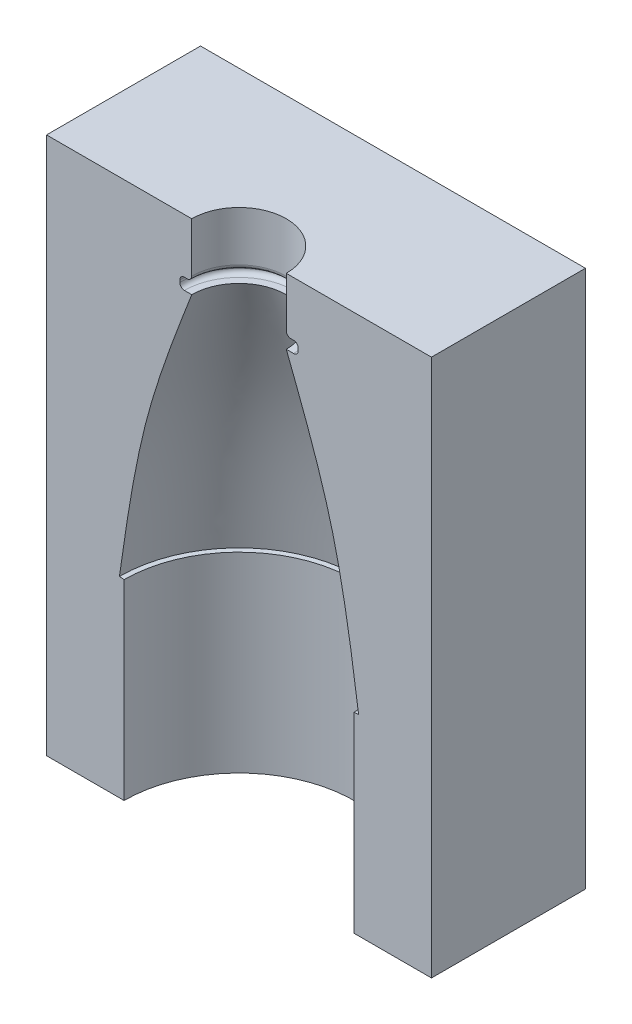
ISO-10303-21;
HEADER;
FILE_DESCRIPTION(('STEP AP214'),'2;1');
FILE_NAME('part.step','',(''),(''),'','','');
FILE_SCHEMA(('AUTOMOTIVE_DESIGN { 1 0 10303 214 1 1 1 1 }'));
ENDSEC;
DATA;
#1=APPLICATION_CONTEXT('core data for automotive mechanical design processes');
#2=APPLICATION_PROTOCOL_DEFINITION('international standard','automotive_design',2000,#1);
#3=PRODUCT_CONTEXT('',#1,'mechanical');
#4=PRODUCT('Part','Part','',(#3));
#5=PRODUCT_RELATED_PRODUCT_CATEGORY('part','',(#4));
#6=PRODUCT_DEFINITION_FORMATION('','',#4);
#7=PRODUCT_DEFINITION_CONTEXT('part definition',#1,'design');
#8=PRODUCT_DEFINITION('design','',#6,#7);
#9=PRODUCT_DEFINITION_SHAPE('','',#8);
#10=(LENGTH_UNIT() NAMED_UNIT(*) SI_UNIT(.MILLI.,.METRE.));
#11=(NAMED_UNIT(*) PLANE_ANGLE_UNIT() SI_UNIT($,.RADIAN.));
#12=(NAMED_UNIT(*) SI_UNIT($,.STERADIAN.) SOLID_ANGLE_UNIT());
#13=UNCERTAINTY_MEASURE_WITH_UNIT(LENGTH_MEASURE(1.E-05),#10,'distance_accuracy_value','');
#14=(GEOMETRIC_REPRESENTATION_CONTEXT(3) GLOBAL_UNCERTAINTY_ASSIGNED_CONTEXT((#13)) GLOBAL_UNIT_ASSIGNED_CONTEXT((#10,
#11,#12)) REPRESENTATION_CONTEXT('',''));
#15=CARTESIAN_POINT('',(0.,0.,0.));
#16=DIRECTION('',(0.,0.,1.));
#17=DIRECTION('',(1.,0.,0.));
#18=AXIS2_PLACEMENT_3D('',#15,#16,#17);
#19=CARTESIAN_POINT('',(-50.,478.395746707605,0.));
#20=DIRECTION('',(0.,0.,-1.));
#21=DIRECTION('',(-1.,0.,0.));
#22=AXIS2_PLACEMENT_3D('',#19,#20,#21);
#23=PLANE('',#22);
#24=DIRECTION('',(-1.,0.,0.));
#25=VECTOR('',#24,1.);
#26=CARTESIAN_POINT('',(321.065605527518,-72.7692633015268,0.));
#27=LINE('',#26,#25);
#28=CARTESIAN_POINT('',(-29.8600456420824,-72.7692633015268,0.));
#29=VERTEX_POINT('',#28);
#30=CARTESIAN_POINT('',(-50.,-72.7692633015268,0.));
#31=VERTEX_POINT('',#30);
#32=EDGE_CURVE('E216',#29,#31,#27,.T.);
#33=ORIENTED_EDGE('',*,*,#32,.F.);
#34=DIRECTION('',(0.,-1.,0.));
#35=VECTOR('',#34,1.);
#36=CARTESIAN_POINT('',(-29.8600456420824,-94.5670098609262,0.));
#37=LINE('',#36,#35);
#38=CARTESIAN_POINT('',(-29.8600456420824,-23.0692633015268,0.));
#39=VERTEX_POINT('',#38);
#40=EDGE_CURVE('E217',#39,#29,#37,.T.);
#41=ORIENTED_EDGE('',*,*,#40,.F.);
#42=DIRECTION('',(-0.99626171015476,0.086386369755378,0.));
#43=VECTOR('',#42,1.);
#44=CARTESIAN_POINT('',(0.,-25.6584433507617,0.));
#45=LINE('',#44,#43);
#46=CARTESIAN_POINT('',(-31.0701882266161,-22.9643312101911,0.));
#47=VERTEX_POINT('',#46);
#48=EDGE_CURVE('E219',#47,#39,#45,.F.);
#49=ORIENTED_EDGE('',*,*,#48,.F.);
#50=CARTESIAN_POINT('',(-31.0701882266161,-22.9643312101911,0.));
#51=CARTESIAN_POINT('',(-29.1413189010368,-9.4723240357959,0.));
#52=CARTESIAN_POINT('',(-25.5704753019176,15.5049239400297,0.));
#53=CARTESIAN_POINT('',(-16.4659018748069,39.0175382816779,0.));
#54=CARTESIAN_POINT('',(-12.2793630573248,49.8292993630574,0.));
#55=CARTESIAN_POINT('',(-12.1883173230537,50.0644255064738,0.));
#56=CARTESIAN_POINT('',(-12.0972715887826,50.2995516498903,0.));
#57=CARTESIAN_POINT('',(-12.0062258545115,50.5346777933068,0.));
#58=B_SPLINE_CURVE_WITH_KNOTS('',3,(#50,#51,#52,#53,#54,#55,#56,#57),.UNSPECIFIED.,.F.,.F.,(4,1,
3,4),(0.,0.540171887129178,1.,1.01),.UNSPECIFIED.);
#59=CARTESIAN_POINT('',(-12.2793630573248,49.8292993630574,0.));
#60=VERTEX_POINT('',#59);
#61=EDGE_CURVE('E221',#60,#47,#58,.F.);
#62=ORIENTED_EDGE('',*,*,#61,.F.);
#63=DIRECTION('',(1.,0.,0.));
#64=VECTOR('',#63,1.);
#65=CARTESIAN_POINT('',(15.3858253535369,49.8292993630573,0.));
#66=LINE('',#65,#64);
#67=CARTESIAN_POINT('',(-14.1858253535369,49.8292993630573,0.));
#68=VERTEX_POINT('',#67);
#69=EDGE_CURVE('E225',#68,#60,#66,.T.);
#70=ORIENTED_EDGE('',*,*,#69,.F.);
#71=CARTESIAN_POINT('',(-14.1858253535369,51.0292993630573,0.));
#72=DIRECTION('',(0.,0.,-1.));
#73=DIRECTION('',(-1.,0.,0.));
#74=AXIS2_PLACEMENT_3D('',#71,#72,#73);
#75=CIRCLE('',#74,1.2);
#76=CARTESIAN_POINT('',(-15.3858253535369,51.0292993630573,0.));
#77=VERTEX_POINT('',#76);
#78=EDGE_CURVE('E226',#77,#68,#75,.F.);
#79=ORIENTED_EDGE('',*,*,#78,.F.);
#80=DIRECTION('',(0.,-1.,0.));
#81=VECTOR('',#80,1.);
#82=CARTESIAN_POINT('',(-15.3858253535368,-94.5670098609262,0.));
#83=LINE('',#82,#81);
#84=CARTESIAN_POINT('',(-15.3858253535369,51.6014165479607,0.));
#85=VERTEX_POINT('',#84);
#86=EDGE_CURVE('E231',#85,#77,#83,.T.);
#87=ORIENTED_EDGE('',*,*,#86,.F.);
#88=CARTESIAN_POINT('',(-14.1858253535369,51.6014165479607,0.));
#89=DIRECTION('',(0.,0.,-1.));
#90=DIRECTION('',(-1.,0.,0.));
#91=AXIS2_PLACEMENT_3D('',#88,#89,#90);
#92=CIRCLE('',#91,1.2);
#93=CARTESIAN_POINT('',(-14.1858253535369,52.8014165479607,0.));
#94=VERTEX_POINT('',#93);
#95=EDGE_CURVE('E233',#94,#85,#92,.F.);
#96=ORIENTED_EDGE('',*,*,#95,.F.);
#97=DIRECTION('',(-1.,0.,0.));
#98=VECTOR('',#97,1.);
#99=CARTESIAN_POINT('',(12.2793630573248,52.8014165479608,0.));
#100=LINE('',#99,#98);
#101=CARTESIAN_POINT('',(-13.4793630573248,52.8014165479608,0.));
#102=VERTEX_POINT('',#101);
#103=EDGE_CURVE('E161',#102,#94,#100,.T.);
#104=ORIENTED_EDGE('',*,*,#103,.F.);
#105=CARTESIAN_POINT('',(-13.4793630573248,54.0014165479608,0.));
#106=DIRECTION('',(0.,0.,-1.));
#107=DIRECTION('',(-1.,0.,0.));
#108=AXIS2_PLACEMENT_3D('',#105,#106,#107);
#109=CIRCLE('',#108,1.2);
#110=CARTESIAN_POINT('',(-12.2793630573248,54.0014165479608,0.));
#111=VERTEX_POINT('',#110);
#112=EDGE_CURVE('E11',#102,#111,#109,.F.);
#113=ORIENTED_EDGE('',*,*,#112,.T.);
#114=DIRECTION('',(0.,-1.,0.));
#115=VECTOR('',#114,1.);
#116=CARTESIAN_POINT('',(-12.2793630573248,-94.5670098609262,0.));
#117=LINE('',#116,#115);
#118=CARTESIAN_POINT('',(-12.2793630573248,66.9136305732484,0.));
#119=VERTEX_POINT('',#118);
#120=EDGE_CURVE('E236',#119,#111,#117,.T.);
#121=ORIENTED_EDGE('',*,*,#120,.F.);
#122=DIRECTION('',(1.,0.,0.));
#123=VECTOR('',#122,1.);
#124=CARTESIAN_POINT('',(-50.,66.9136305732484,0.));
#125=LINE('',#124,#123);
#126=CARTESIAN_POINT('',(-50.,66.9136305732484,0.));
#127=VERTEX_POINT('',#126);
#128=EDGE_CURVE('E235',#127,#119,#125,.T.);
#129=ORIENTED_EDGE('',*,*,#128,.F.);
#130=DIRECTION('',(0.,-1.,0.));
#131=VECTOR('',#130,1.);
#132=CARTESIAN_POINT('',(-50.,478.395746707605,0.));
#133=LINE('',#132,#131);
#134=EDGE_CURVE('E262',#127,#31,#133,.T.);
#135=ORIENTED_EDGE('',*,*,#134,.T.);
#136=EDGE_LOOP('',(#33,#41,#49,#62,#70,#79,#87,#96,#104,#113,#121,#129,#135));
#137=FACE_BOUND('',#136,.T.);
#138=ADVANCED_FACE('F33',(#137),#23,.F.);
#139=CARTESIAN_POINT('',(321.065605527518,-72.7692633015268,40.));
#140=DIRECTION('',(0.,1.,0.));
#141=DIRECTION('',(0.,0.,1.));
#142=AXIS2_PLACEMENT_3D('',#139,#140,#141);
#143=PLANE('',#142);
#144=DIRECTION('',(0.,0.,-1.));
#145=VECTOR('',#144,1.);
#146=CARTESIAN_POINT('',(50.,-72.7692633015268,40.));
#147=LINE('',#146,#145);
#148=CARTESIAN_POINT('',(50.,-72.7692633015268,0.));
#149=VERTEX_POINT('',#148);
#150=CARTESIAN_POINT('',(50.,-72.7692633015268,-40.));
#151=VERTEX_POINT('',#150);
#152=EDGE_CURVE('E201',#149,#151,#147,.T.);
#153=ORIENTED_EDGE('',*,*,#152,.F.);
#154=CARTESIAN_POINT('',(29.8600456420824,-72.7692633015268,0.));
#155=VERTEX_POINT('',#154);
#156=EDGE_CURVE('E239',#149,#155,#27,.T.);
#157=ORIENTED_EDGE('',*,*,#156,.T.);
#158=CARTESIAN_POINT('',(0.,-72.7692633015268,0.));
#159=DIRECTION('',(0.,1.,0.));
#160=DIRECTION('',(0.,0.,1.));
#161=AXIS2_PLACEMENT_3D('',#158,#159,#160);
#162=CIRCLE('',#161,29.8600456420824);
#163=EDGE_CURVE('E148',#155,#29,#162,.T.);
#164=ORIENTED_EDGE('',*,*,#163,.T.);
#165=ORIENTED_EDGE('',*,*,#32,.T.);
#166=DIRECTION('',(0.,0.,1.));
#167=VECTOR('',#166,1.);
#168=CARTESIAN_POINT('',(-50.,-72.7692633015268,40.));
#169=LINE('',#168,#167);
#170=CARTESIAN_POINT('',(-50.,-72.7692633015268,-40.));
#171=VERTEX_POINT('',#170);
#172=EDGE_CURVE('E211',#171,#31,#169,.T.);
#173=ORIENTED_EDGE('',*,*,#172,.F.);
#174=DIRECTION('',(-1.,0.,0.));
#175=VECTOR('',#174,1.);
#176=CARTESIAN_POINT('',(321.065605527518,-72.7692633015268,-40.));
#177=LINE('',#176,#175);
#178=EDGE_CURVE('E214',#151,#171,#177,.T.);
#179=ORIENTED_EDGE('',*,*,#178,.F.);
#180=EDGE_LOOP('',(#153,#157,#164,#165,#173,#179));
#181=FACE_BOUND('',#180,.T.);
#182=ADVANCED_FACE('F283',(#181),#143,.F.);
#183=CARTESIAN_POINT('',(50.,-108.086369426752,40.));
#184=DIRECTION('',(-1.,0.,0.));
#185=DIRECTION('',(0.,0.,1.));
#186=AXIS2_PLACEMENT_3D('',#183,#184,#185);
#187=PLANE('',#186);
#188=DIRECTION('',(0.,0.,-1.));
#189=VECTOR('',#188,1.);
#190=CARTESIAN_POINT('',(50.,66.9136305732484,40.));
#191=LINE('',#190,#189);
#192=CARTESIAN_POINT('',(50.,66.9136305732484,0.));
#193=VERTEX_POINT('',#192);
#194=CARTESIAN_POINT('',(50.,66.9136305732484,-40.));
#195=VERTEX_POINT('',#194);
#196=EDGE_CURVE('E204',#193,#195,#191,.T.);
#197=ORIENTED_EDGE('',*,*,#196,.F.);
#198=DIRECTION('',(0.,-1.,0.));
#199=VECTOR('',#198,1.);
#200=CARTESIAN_POINT('',(50.,478.395746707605,0.));
#201=LINE('',#200,#199);
#202=EDGE_CURVE('E49',#193,#149,#201,.T.);
#203=ORIENTED_EDGE('',*,*,#202,.T.);
#204=ORIENTED_EDGE('',*,*,#152,.T.);
#205=DIRECTION('',(0.,1.,0.));
#206=VECTOR('',#205,1.);
#207=CARTESIAN_POINT('',(50.,-108.086369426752,-40.));
#208=LINE('',#207,#206);
#209=EDGE_CURVE('E177',#151,#195,#208,.T.);
#210=ORIENTED_EDGE('',*,*,#209,.T.);
#211=EDGE_LOOP('',(#197,#203,#204,#210));
#212=FACE_BOUND('',#211,.T.);
#213=ADVANCED_FACE('F332',(#212),#187,.F.);
#214=CARTESIAN_POINT('',(-50.,66.9136305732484,40.));
#215=DIRECTION('',(0.,-1.,0.));
#216=DIRECTION('',(0.,0.,-1.));
#217=AXIS2_PLACEMENT_3D('',#214,#215,#216);
#218=PLANE('',#217);
#219=DIRECTION('',(0.,0.,-1.));
#220=VECTOR('',#219,1.);
#221=CARTESIAN_POINT('',(-50.,66.9136305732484,40.));
#222=LINE('',#221,#220);
#223=CARTESIAN_POINT('',(-50.,66.9136305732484,-40.));
#224=VERTEX_POINT('',#223);
#225=EDGE_CURVE('E188',#127,#224,#222,.T.);
#226=ORIENTED_EDGE('',*,*,#225,.F.);
#227=ORIENTED_EDGE('',*,*,#128,.T.);
#228=CARTESIAN_POINT('',(0.,66.9136305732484,0.));
#229=DIRECTION('',(0.,-1.,0.));
#230=DIRECTION('',(0.,0.,-1.));
#231=AXIS2_PLACEMENT_3D('',#228,#229,#230);
#232=CIRCLE('',#231,12.2793630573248);
#233=CARTESIAN_POINT('',(12.2793630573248,66.9136305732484,0.));
#234=VERTEX_POINT('',#233);
#235=EDGE_CURVE('E171',#119,#234,#232,.T.);
#236=ORIENTED_EDGE('',*,*,#235,.T.);
#237=EDGE_CURVE('E57',#234,#193,#125,.T.);
#238=ORIENTED_EDGE('',*,*,#237,.T.);
#239=ORIENTED_EDGE('',*,*,#196,.T.);
#240=DIRECTION('',(-1.,0.,0.));
#241=VECTOR('',#240,1.);
#242=CARTESIAN_POINT('',(-50.,66.9136305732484,-40.));
#243=LINE('',#242,#241);
#244=EDGE_CURVE('E176',#195,#224,#243,.T.);
#245=ORIENTED_EDGE('',*,*,#244,.T.);
#246=EDGE_LOOP('',(#226,#227,#236,#238,#239,#245));
#247=FACE_BOUND('',#246,.T.);
#248=ADVANCED_FACE('F274',(#247),#218,.F.);
#249=CARTESIAN_POINT('',(-50.,-108.086369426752,40.));
#250=DIRECTION('',(1.,0.,0.));
#251=DIRECTION('',(0.,0.,-1.));
#252=AXIS2_PLACEMENT_3D('',#249,#250,#251);
#253=PLANE('',#252);
#254=ORIENTED_EDGE('',*,*,#172,.T.);
#255=ORIENTED_EDGE('',*,*,#134,.F.);
#256=ORIENTED_EDGE('',*,*,#225,.T.);
#257=DIRECTION('',(0.,-1.,0.));
#258=VECTOR('',#257,1.);
#259=CARTESIAN_POINT('',(-50.,-108.086369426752,-40.));
#260=LINE('',#259,#258);
#261=EDGE_CURVE('E205',#224,#171,#260,.T.);
#262=ORIENTED_EDGE('',*,*,#261,.T.);
#263=EDGE_LOOP('',(#254,#255,#256,#262));
#264=FACE_BOUND('',#263,.T.);
#265=ADVANCED_FACE('F272',(#264),#253,.F.);
#266=CARTESIAN_POINT('',(50.,66.9136305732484,-40.));
#267=DIRECTION('',(0.,0.,-1.));
#268=DIRECTION('',(-1.,0.,0.));
#269=AXIS2_PLACEMENT_3D('',#266,#267,#268);
#270=PLANE('',#269);
#271=ORIENTED_EDGE('',*,*,#178,.T.);
#272=ORIENTED_EDGE('',*,*,#261,.F.);
#273=ORIENTED_EDGE('',*,*,#244,.F.);
#274=ORIENTED_EDGE('',*,*,#209,.F.);
#275=EDGE_LOOP('',(#271,#272,#273,#274));
#276=FACE_BOUND('',#275,.T.);
#277=ADVANCED_FACE('F280',(#276),#270,.T.);
#278=CARTESIAN_POINT('',(0.,-94.5670098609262,0.));
#279=DIRECTION('',(0.,-1.,0.));
#280=DIRECTION('',(0.,0.,-1.));
#281=AXIS2_PLACEMENT_3D('',#278,#279,#280);
#282=CYLINDRICAL_SURFACE('',#281,29.8600456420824);
#283=ORIENTED_EDGE('',*,*,#163,.F.);
#284=DIRECTION('',(0.,-1.,0.));
#285=VECTOR('',#284,1.);
#286=CARTESIAN_POINT('',(29.8600456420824,-94.5670098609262,0.));
#287=LINE('',#286,#285);
#288=CARTESIAN_POINT('',(29.8600456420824,-23.0692633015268,0.));
#289=VERTEX_POINT('',#288);
#290=EDGE_CURVE('E241',#155,#289,#287,.F.);
#291=ORIENTED_EDGE('',*,*,#290,.T.);
#292=CARTESIAN_POINT('',(0.,-23.0692633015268,0.));
#293=DIRECTION('',(0.,-1.,0.));
#294=DIRECTION('',(0.,0.,-1.));
#295=AXIS2_PLACEMENT_3D('',#292,#293,#294);
#296=CIRCLE('',#295,29.8600456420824);
#297=EDGE_CURVE('E185',#39,#289,#296,.T.);
#298=ORIENTED_EDGE('',*,*,#297,.F.);
#299=ORIENTED_EDGE('',*,*,#40,.T.);
#300=EDGE_LOOP('',(#283,#291,#298,#299));
#301=FACE_BOUND('',#300,.T.);
#302=ADVANCED_FACE('F287',(#301),#282,.F.);
#303=CARTESIAN_POINT('',(0.,-23.0692633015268,0.));
#304=DIRECTION('',(0.,1.,0.));
#305=DIRECTION('',(0.,0.,1.));
#306=AXIS2_PLACEMENT_3D('',#303,#304,#305);
#307=CONICAL_SURFACE('',#306,29.8600456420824,1.48430215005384);
#308=CARTESIAN_POINT('',(0.,-22.9643312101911,0.));
#309=DIRECTION('',(0.,-1.,0.));
#310=DIRECTION('',(0.,0.,-1.));
#311=AXIS2_PLACEMENT_3D('',#308,#309,#310);
#312=CIRCLE('',#311,31.0701882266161);
#313=CARTESIAN_POINT('',(31.0701882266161,-22.9643312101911,0.));
#314=VERTEX_POINT('',#313);
#315=EDGE_CURVE('E182',#47,#314,#312,.T.);
#316=ORIENTED_EDGE('',*,*,#315,.F.);
#317=ORIENTED_EDGE('',*,*,#48,.T.);
#318=ORIENTED_EDGE('',*,*,#297,.T.);
#319=DIRECTION('',(-0.99626171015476,-0.086386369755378,0.));
#320=VECTOR('',#319,1.);
#321=CARTESIAN_POINT('',(0.,-25.6584433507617,0.));
#322=LINE('',#321,#320);
#323=EDGE_CURVE('E243',#289,#314,#322,.F.);
#324=ORIENTED_EDGE('',*,*,#323,.T.);
#325=EDGE_LOOP('',(#316,#317,#318,#324));
#326=FACE_BOUND('',#325,.T.);
#327=ADVANCED_FACE('F294',(#326),#307,.F.);
#328=CARTESIAN_POINT('',(31.0701882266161,-22.9643312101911,0.));
#329=CARTESIAN_POINT('',(29.1413189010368,-9.4723240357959,0.));
#330=CARTESIAN_POINT('',(25.5704753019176,15.5049239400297,0.));
#331=CARTESIAN_POINT('',(16.4659018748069,39.0175382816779,0.));
#332=CARTESIAN_POINT('',(12.2793630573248,49.8292993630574,0.));
#333=CARTESIAN_POINT('',(12.1883173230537,50.0644255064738,0.));
#334=CARTESIAN_POINT('',(12.0972715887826,50.2995516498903,0.));
#335=CARTESIAN_POINT('',(12.0062258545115,50.5346777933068,0.));
#336=B_SPLINE_CURVE_WITH_KNOTS('',3,(#328,#329,#330,#331,#332,#333,#334,#335),.UNSPECIFIED.,.F.,
.F.,(4,1,3,4),(0.,0.540171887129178,1.,1.01),.UNSPECIFIED.);
#337=CARTESIAN_POINT('',(0.,-94.5670098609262,0.));
#338=DIRECTION('',(0.,-1.,0.));
#339=AXIS1_PLACEMENT('',#337,#338);
#340=SURFACE_OF_REVOLUTION('',#336,#339);
#341=ORIENTED_EDGE('',*,*,#315,.T.);
#342=CARTESIAN_POINT('',(31.0701882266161,-22.9643312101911,0.));
#343=CARTESIAN_POINT('',(29.1413189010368,-9.4723240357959,0.));
#344=CARTESIAN_POINT('',(25.5704753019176,15.5049239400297,0.));
#345=CARTESIAN_POINT('',(16.4659018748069,39.0175382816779,0.));
#346=CARTESIAN_POINT('',(12.2793630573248,49.8292993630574,0.));
#347=CARTESIAN_POINT('',(12.1883173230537,50.0644255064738,0.));
#348=CARTESIAN_POINT('',(12.0972715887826,50.2995516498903,0.));
#349=CARTESIAN_POINT('',(12.0062258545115,50.5346777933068,0.));
#350=B_SPLINE_CURVE_WITH_KNOTS('',3,(#342,#343,#344,#345,#346,#347,#348,#349),.UNSPECIFIED.,.F.,
.F.,(4,1,3,4),(0.,0.540171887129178,1.,1.01),.UNSPECIFIED.);
#351=CARTESIAN_POINT('',(12.2793630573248,49.8292993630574,0.));
#352=VERTEX_POINT('',#351);
#353=EDGE_CURVE('E245',#314,#352,#350,.T.);
#354=ORIENTED_EDGE('',*,*,#353,.T.);
#355=CARTESIAN_POINT('',(0.,49.8292993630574,0.));
#356=DIRECTION('',(0.,-1.,0.));
#357=DIRECTION('',(0.,0.,-1.));
#358=AXIS2_PLACEMENT_3D('',#355,#356,#357);
#359=CIRCLE('',#358,12.2793630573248);
#360=EDGE_CURVE('E178',#60,#352,#359,.T.);
#361=ORIENTED_EDGE('',*,*,#360,.F.);
#362=ORIENTED_EDGE('',*,*,#61,.T.);
#363=EDGE_LOOP('',(#341,#354,#361,#362));
#364=FACE_BOUND('',#363,.T.);
#365=ADVANCED_FACE('F35',(#364),#340,.T.);
#366=CARTESIAN_POINT('',(15.3858253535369,49.8292993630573,0.));
#367=DIRECTION('',(0.,-1.,0.));
#368=DIRECTION('',(0.,0.,-1.));
#369=AXIS2_PLACEMENT_3D('',#366,#367,#368);
#370=PLANE('',#369);
#371=CARTESIAN_POINT('',(0.,49.8292993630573,0.));
#372=DIRECTION('',(0.,-1.,0.));
#373=DIRECTION('',(0.,0.,-1.));
#374=AXIS2_PLACEMENT_3D('',#371,#372,#373);
#375=CIRCLE('',#374,14.1858253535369);
#376=CARTESIAN_POINT('',(14.1858253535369,49.8292993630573,0.));
#377=VERTEX_POINT('',#376);
#378=EDGE_CURVE('E189',#68,#377,#375,.T.);
#379=ORIENTED_EDGE('',*,*,#378,.F.);
#380=ORIENTED_EDGE('',*,*,#69,.T.);
#381=ORIENTED_EDGE('',*,*,#360,.T.);
#382=EDGE_CURVE('E249',#352,#377,#66,.T.);
#383=ORIENTED_EDGE('',*,*,#382,.T.);
#384=EDGE_LOOP('',(#379,#380,#381,#383));
#385=FACE_BOUND('',#384,.T.);
#386=ADVANCED_FACE('F304',(#385),#370,.F.);
#387=CARTESIAN_POINT('',(0.,-94.5670098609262,0.));
#388=DIRECTION('',(0.,-1.,0.));
#389=DIRECTION('',(0.,0.,-1.));
#390=AXIS2_PLACEMENT_3D('',#387,#388,#389);
#391=CYLINDRICAL_SURFACE('',#390,15.3858253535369);
#392=CARTESIAN_POINT('',(0.,51.0292993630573,0.));
#393=DIRECTION('',(0.,-1.,0.));
#394=DIRECTION('',(0.,0.,-1.));
#395=AXIS2_PLACEMENT_3D('',#392,#393,#394);
#396=CIRCLE('',#395,15.3858253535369);
#397=CARTESIAN_POINT('',(15.3858253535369,51.0292993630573,0.));
#398=VERTEX_POINT('',#397);
#399=EDGE_CURVE('E181',#398,#77,#396,.F.);
#400=ORIENTED_EDGE('',*,*,#399,.F.);
#401=DIRECTION('',(0.,-1.,0.));
#402=VECTOR('',#401,1.);
#403=CARTESIAN_POINT('',(15.3858253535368,-94.5670098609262,0.));
#404=LINE('',#403,#402);
#405=CARTESIAN_POINT('',(15.3858253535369,51.6014165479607,0.));
#406=VERTEX_POINT('',#405);
#407=EDGE_CURVE('E256',#398,#406,#404,.F.);
#408=ORIENTED_EDGE('',*,*,#407,.T.);
#409=CARTESIAN_POINT('',(0.,51.6014165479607,0.));
#410=DIRECTION('',(0.,1.,0.));
#411=DIRECTION('',(0.,0.,1.));
#412=AXIS2_PLACEMENT_3D('',#409,#410,#411);
#413=CIRCLE('',#412,15.3858253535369);
#414=EDGE_CURVE('E192',#85,#406,#413,.F.);
#415=ORIENTED_EDGE('',*,*,#414,.F.);
#416=ORIENTED_EDGE('',*,*,#86,.T.);
#417=EDGE_LOOP('',(#400,#408,#415,#416));
#418=FACE_BOUND('',#417,.T.);
#419=ADVANCED_FACE('F312',(#418),#391,.F.);
#420=CARTESIAN_POINT('',(12.2793630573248,52.8014165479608,0.));
#421=DIRECTION('',(0.,1.,0.));
#422=DIRECTION('',(0.,0.,1.));
#423=AXIS2_PLACEMENT_3D('',#420,#421,#422);
#424=PLANE('',#423);
#425=CARTESIAN_POINT('',(0.,52.8014165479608,0.));
#426=DIRECTION('',(0.,1.,0.));
#427=DIRECTION('',(0.,0.,1.));
#428=AXIS2_PLACEMENT_3D('',#425,#426,#427);
#429=CIRCLE('',#428,14.1858253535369);
#430=CARTESIAN_POINT('',(14.1858253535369,52.8014165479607,0.));
#431=VERTEX_POINT('',#430);
#432=EDGE_CURVE('E156',#431,#94,#429,.T.);
#433=ORIENTED_EDGE('',*,*,#432,.F.);
#434=CARTESIAN_POINT('',(13.4793630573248,52.8014165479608,0.));
#435=VERTEX_POINT('',#434);
#436=EDGE_CURVE('E153',#431,#435,#100,.T.);
#437=ORIENTED_EDGE('',*,*,#436,.T.);
#438=CARTESIAN_POINT('',(0.,52.8014165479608,0.));
#439=DIRECTION('',(0.,1.,0.));
#440=DIRECTION('',(0.,0.,1.));
#441=AXIS2_PLACEMENT_3D('',#438,#439,#440);
#442=CIRCLE('',#441,13.4793630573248);
#443=EDGE_CURVE('E141',#102,#435,#442,.F.);
#444=ORIENTED_EDGE('',*,*,#443,.F.);
#445=ORIENTED_EDGE('',*,*,#103,.T.);
#446=EDGE_LOOP('',(#433,#437,#444,#445));
#447=FACE_BOUND('',#446,.T.);
#448=ADVANCED_FACE('F154',(#447),#424,.F.);
#449=CARTESIAN_POINT('',(0.,-94.5670098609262,0.));
#450=DIRECTION('',(0.,-1.,0.));
#451=DIRECTION('',(0.,0.,-1.));
#452=AXIS2_PLACEMENT_3D('',#449,#450,#451);
#453=CYLINDRICAL_SURFACE('',#452,12.2793630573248);
#454=CARTESIAN_POINT('',(0.,54.0014165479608,0.));
#455=DIRECTION('',(0.,1.,0.));
#456=DIRECTION('',(0.,0.,1.));
#457=AXIS2_PLACEMENT_3D('',#454,#455,#456);
#458=CIRCLE('',#457,12.2793630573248);
#459=CARTESIAN_POINT('',(12.2793630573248,54.0014165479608,0.));
#460=VERTEX_POINT('',#459);
#461=EDGE_CURVE('E149',#460,#111,#458,.T.);
#462=ORIENTED_EDGE('',*,*,#461,.F.);
#463=DIRECTION('',(0.,-1.,0.));
#464=VECTOR('',#463,1.);
#465=CARTESIAN_POINT('',(12.2793630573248,-94.5670098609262,0.));
#466=LINE('',#465,#464);
#467=EDGE_CURVE('E159',#460,#234,#466,.F.);
#468=ORIENTED_EDGE('',*,*,#467,.T.);
#469=ORIENTED_EDGE('',*,*,#235,.F.);
#470=ORIENTED_EDGE('',*,*,#120,.T.);
#471=EDGE_LOOP('',(#462,#468,#469,#470));
#472=FACE_BOUND('',#471,.T.);
#473=ADVANCED_FACE('F317',(#472),#453,.F.);
#474=CARTESIAN_POINT('',(0.,51.0292993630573,0.));
#475=DIRECTION('',(0.,-1.,0.));
#476=DIRECTION('',(0.,0.,-1.));
#477=AXIS2_PLACEMENT_3D('',#474,#475,#476);
#478=TOROIDAL_SURFACE('',#477,14.1858253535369,1.2);
#479=ORIENTED_EDGE('',*,*,#378,.T.);
#480=CARTESIAN_POINT('',(14.1858253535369,51.0292993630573,0.));
#481=DIRECTION('',(0.,0.,-1.));
#482=DIRECTION('',(-1.,0.,0.));
#483=AXIS2_PLACEMENT_3D('',#480,#481,#482);
#484=CIRCLE('',#483,1.2);
#485=EDGE_CURVE('E254',#377,#398,#484,.F.);
#486=ORIENTED_EDGE('',*,*,#485,.T.);
#487=ORIENTED_EDGE('',*,*,#399,.T.);
#488=ORIENTED_EDGE('',*,*,#78,.T.);
#489=EDGE_LOOP('',(#479,#486,#487,#488));
#490=FACE_BOUND('',#489,.T.);
#491=ADVANCED_FACE('F307',(#490),#478,.F.);
#492=CARTESIAN_POINT('',(0.,51.6014165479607,0.));
#493=DIRECTION('',(0.,1.,0.));
#494=DIRECTION('',(0.,0.,1.));
#495=AXIS2_PLACEMENT_3D('',#492,#493,#494);
#496=TOROIDAL_SURFACE('',#495,14.1858253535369,1.2);
#497=ORIENTED_EDGE('',*,*,#432,.T.);
#498=ORIENTED_EDGE('',*,*,#95,.T.);
#499=ORIENTED_EDGE('',*,*,#414,.T.);
#500=CARTESIAN_POINT('',(14.1858253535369,51.6014165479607,0.));
#501=DIRECTION('',(0.,0.,-1.));
#502=DIRECTION('',(-1.,0.,0.));
#503=AXIS2_PLACEMENT_3D('',#500,#501,#502);
#504=CIRCLE('',#503,1.2);
#505=EDGE_CURVE('E258',#406,#431,#504,.F.);
#506=ORIENTED_EDGE('',*,*,#505,.T.);
#507=EDGE_LOOP('',(#497,#498,#499,#506));
#508=FACE_BOUND('',#507,.T.);
#509=ADVANCED_FACE('F314',(#508),#496,.F.);
#510=CARTESIAN_POINT('',(0.,54.0014165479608,0.));
#511=DIRECTION('',(0.,1.,0.));
#512=DIRECTION('',(0.,0.,1.));
#513=AXIS2_PLACEMENT_3D('',#510,#511,#512);
#514=TOROIDAL_SURFACE('',#513,13.4793630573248,1.2);
#515=ORIENTED_EDGE('',*,*,#112,.F.);
#516=ORIENTED_EDGE('',*,*,#443,.T.);
#517=CARTESIAN_POINT('',(13.4793630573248,54.0014165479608,0.));
#518=DIRECTION('',(0.,0.,-1.));
#519=DIRECTION('',(-1.,0.,0.));
#520=AXIS2_PLACEMENT_3D('',#517,#518,#519);
#521=CIRCLE('',#520,1.2);
#522=EDGE_CURVE('E42',#460,#435,#521,.F.);
#523=ORIENTED_EDGE('',*,*,#522,.F.);
#524=ORIENTED_EDGE('',*,*,#461,.T.);
#525=EDGE_LOOP('',(#515,#516,#523,#524));
#526=FACE_BOUND('',#525,.T.);
#527=ADVANCED_FACE('F143',(#526),#514,.T.);
#528=ORIENTED_EDGE('',*,*,#156,.F.);
#529=ORIENTED_EDGE('',*,*,#202,.F.);
#530=ORIENTED_EDGE('',*,*,#237,.F.);
#531=ORIENTED_EDGE('',*,*,#467,.F.);
#532=ORIENTED_EDGE('',*,*,#522,.T.);
#533=ORIENTED_EDGE('',*,*,#436,.F.);
#534=ORIENTED_EDGE('',*,*,#505,.F.);
#535=ORIENTED_EDGE('',*,*,#407,.F.);
#536=ORIENTED_EDGE('',*,*,#485,.F.);
#537=ORIENTED_EDGE('',*,*,#382,.F.);
#538=ORIENTED_EDGE('',*,*,#353,.F.);
#539=ORIENTED_EDGE('',*,*,#323,.F.);
#540=ORIENTED_EDGE('',*,*,#290,.F.);
#541=EDGE_LOOP('',(#528,#529,#530,#531,#532,#533,#534,#535,#536,#537,#538,#539,#540));
#542=FACE_BOUND('',#541,.T.);
#543=ADVANCED_FACE('F164',(#542),#23,.F.);
#544=CLOSED_SHELL('',(#138,#182,#213,#248,#265,#277,#302,#327,#365,#386,#419,#448,#473,#491,
#509,#527,#543));
#545=MANIFOLD_SOLID_BREP('B2',#544);
#546=ADVANCED_BREP_SHAPE_REPRESENTATION('',(#18,#545),#14);
#547=SHAPE_DEFINITION_REPRESENTATION(#9,#546);
ENDSEC;
END-ISO-10303-21;
